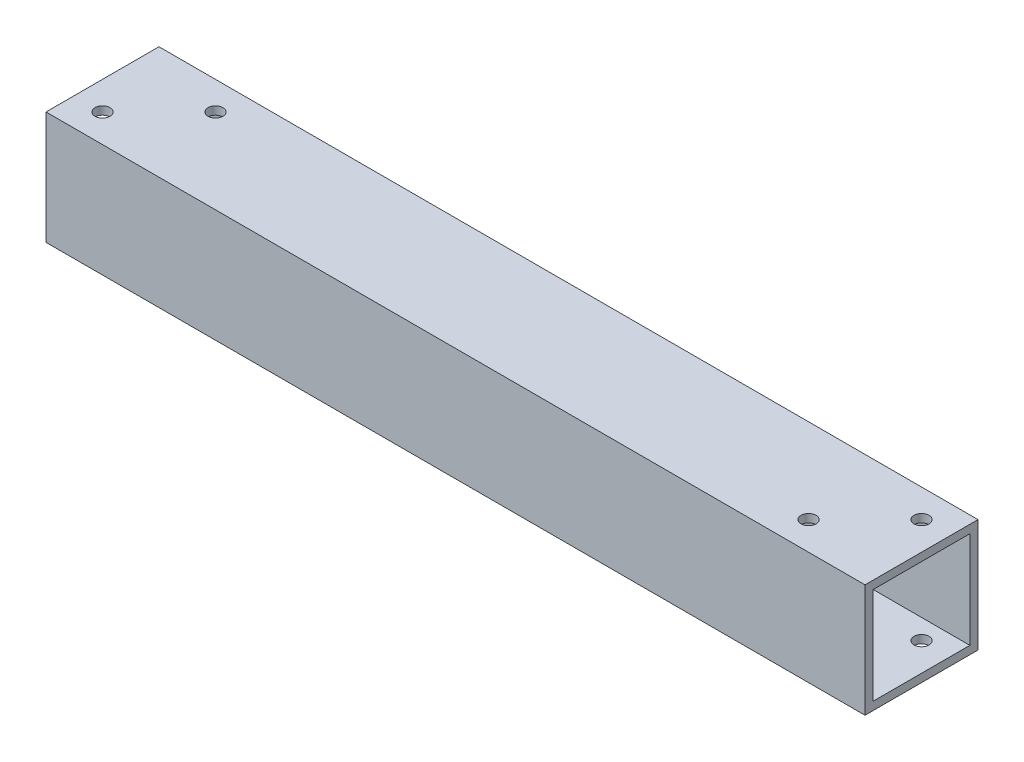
ISO-10303-21;
HEADER;
FILE_DESCRIPTION(('STEP AP214'),'2;1');
FILE_NAME('part.step','',(''),(''),'','','');
FILE_SCHEMA(('AUTOMOTIVE_DESIGN { 1 0 10303 214 1 1 1 1 }'));
ENDSEC;
DATA;
#1=APPLICATION_CONTEXT('core data for automotive mechanical design processes');
#2=APPLICATION_PROTOCOL_DEFINITION('international standard','automotive_design',2000,#1);
#3=PRODUCT_CONTEXT('',#1,'mechanical');
#4=PRODUCT('Part','Part','',(#3));
#5=PRODUCT_RELATED_PRODUCT_CATEGORY('part','',(#4));
#6=PRODUCT_DEFINITION_FORMATION('','',#4);
#7=PRODUCT_DEFINITION_CONTEXT('part definition',#1,'design');
#8=PRODUCT_DEFINITION('design','',#6,#7);
#9=PRODUCT_DEFINITION_SHAPE('','',#8);
#10=(LENGTH_UNIT() NAMED_UNIT(*) SI_UNIT(.MILLI.,.METRE.));
#11=(NAMED_UNIT(*) PLANE_ANGLE_UNIT() SI_UNIT($,.RADIAN.));
#12=(NAMED_UNIT(*) SI_UNIT($,.STERADIAN.) SOLID_ANGLE_UNIT());
#13=UNCERTAINTY_MEASURE_WITH_UNIT(LENGTH_MEASURE(1.E-05),#10,'distance_accuracy_value','');
#14=(GEOMETRIC_REPRESENTATION_CONTEXT(3) GLOBAL_UNCERTAINTY_ASSIGNED_CONTEXT((#13)) GLOBAL_UNIT_ASSIGNED_CONTEXT((#10,
#11,#12)) REPRESENTATION_CONTEXT('',''));
#15=CARTESIAN_POINT('',(0.,0.,0.));
#16=DIRECTION('',(0.,0.,1.));
#17=DIRECTION('',(1.,0.,0.));
#18=AXIS2_PLACEMENT_3D('',#15,#16,#17);
#19=CARTESIAN_POINT('',(368.3,50.8000000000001,0.));
#20=DIRECTION('',(-1.,0.,0.));
#21=DIRECTION('',(0.,0.,1.));
#22=AXIS2_PLACEMENT_3D('',#19,#20,#21);
#23=PLANE('',#22);
#24=DIRECTION('',(0.,-0.999999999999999,0.));
#25=VECTOR('',#24,1.);
#26=CARTESIAN_POINT('',(368.3,0.,0.));
#27=LINE('',#26,#25);
#28=CARTESIAN_POINT('',(368.3,50.8000000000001,0.));
#29=VERTEX_POINT('',#28);
#30=CARTESIAN_POINT('',(368.3,0.,0.));
#31=VERTEX_POINT('',#30);
#32=EDGE_CURVE('E135',#29,#31,#27,.T.);
#33=ORIENTED_EDGE('',*,*,#32,.T.);
#34=DIRECTION('',(0.,0.,-1.));
#35=VECTOR('',#34,1.);
#36=CARTESIAN_POINT('',(368.3,0.,0.));
#37=LINE('',#36,#35);
#38=CARTESIAN_POINT('',(368.3,0.,-50.7999999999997));
#39=VERTEX_POINT('',#38);
#40=EDGE_CURVE('E138',#31,#39,#37,.T.);
#41=ORIENTED_EDGE('',*,*,#40,.T.);
#42=DIRECTION('',(0.,0.999999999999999,0.));
#43=VECTOR('',#42,1.);
#44=CARTESIAN_POINT('',(368.3,0.,-50.7999999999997));
#45=LINE('',#44,#43);
#46=CARTESIAN_POINT('',(368.3,50.8000000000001,-50.7999999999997));
#47=VERTEX_POINT('',#46);
#48=EDGE_CURVE('E141',#39,#47,#45,.T.);
#49=ORIENTED_EDGE('',*,*,#48,.T.);
#50=DIRECTION('',(0.,0.,1.));
#51=VECTOR('',#50,1.);
#52=CARTESIAN_POINT('',(368.3,50.8000000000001,0.));
#53=LINE('',#52,#51);
#54=EDGE_CURVE('E143',#47,#29,#53,.T.);
#55=ORIENTED_EDGE('',*,*,#54,.T.);
#56=EDGE_LOOP('',(#33,#41,#49,#55));
#57=FACE_BOUND('',#56,.T.);
#58=DIRECTION('',(0.,-0.999999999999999,0.));
#59=VECTOR('',#58,1.);
#60=CARTESIAN_POINT('',(368.3,47.1423999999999,-3.65759999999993));
#61=LINE('',#60,#59);
#62=CARTESIAN_POINT('',(368.3,47.1423999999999,-3.65759999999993));
#63=VERTEX_POINT('',#62);
#64=CARTESIAN_POINT('',(368.3,3.65760000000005,-3.65759999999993));
#65=VERTEX_POINT('',#64);
#66=EDGE_CURVE('E97',#63,#65,#61,.T.);
#67=ORIENTED_EDGE('',*,*,#66,.F.);
#68=DIRECTION('',(0.,0.,1.));
#69=VECTOR('',#68,1.);
#70=CARTESIAN_POINT('',(368.3,47.1423999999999,-3.65759999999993));
#71=LINE('',#70,#69);
#72=CARTESIAN_POINT('',(368.3,47.1423999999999,-47.1423999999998));
#73=VERTEX_POINT('',#72);
#74=EDGE_CURVE('E119',#73,#63,#71,.T.);
#75=ORIENTED_EDGE('',*,*,#74,.F.);
#76=DIRECTION('',(0.,0.999999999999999,0.));
#77=VECTOR('',#76,1.);
#78=CARTESIAN_POINT('',(368.3,47.1423999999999,-47.1423999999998));
#79=LINE('',#78,#77);
#80=CARTESIAN_POINT('',(368.3,3.65760000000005,-47.1423999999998));
#81=VERTEX_POINT('',#80);
#82=EDGE_CURVE('E117',#81,#73,#79,.T.);
#83=ORIENTED_EDGE('',*,*,#82,.F.);
#84=DIRECTION('',(0.,0.,-1.));
#85=VECTOR('',#84,1.);
#86=CARTESIAN_POINT('',(368.3,3.65760000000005,-3.65759999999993));
#87=LINE('',#86,#85);
#88=EDGE_CURVE('E105',#65,#81,#87,.T.);
#89=ORIENTED_EDGE('',*,*,#88,.F.);
#90=EDGE_LOOP('',(#67,#75,#83,#89));
#91=FACE_BOUND('',#90,.T.);
#92=ADVANCED_FACE('F30',(#57,#91),#23,.F.);
#93=CARTESIAN_POINT('',(0.,50.7999999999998,0.));
#94=DIRECTION('',(-1.,0.,0.));
#95=DIRECTION('',(0.,0.,1.));
#96=AXIS2_PLACEMENT_3D('',#93,#94,#95);
#97=PLANE('',#96);
#98=DIRECTION('',(0.,-0.999999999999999,0.));
#99=VECTOR('',#98,1.);
#100=CARTESIAN_POINT('',(0.,0.,0.));
#101=LINE('',#100,#99);
#102=CARTESIAN_POINT('',(0.,50.7999999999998,0.));
#103=VERTEX_POINT('',#102);
#104=CARTESIAN_POINT('',(0.,0.,0.));
#105=VERTEX_POINT('',#104);
#106=EDGE_CURVE('E113',#103,#105,#101,.T.);
#107=ORIENTED_EDGE('',*,*,#106,.F.);
#108=DIRECTION('',(0.,0.,1.));
#109=VECTOR('',#108,1.);
#110=CARTESIAN_POINT('',(0.,50.7999999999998,0.));
#111=LINE('',#110,#109);
#112=CARTESIAN_POINT('',(0.,50.7999999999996,-50.8000000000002));
#113=VERTEX_POINT('',#112);
#114=EDGE_CURVE('E139',#113,#103,#111,.T.);
#115=ORIENTED_EDGE('',*,*,#114,.F.);
#116=DIRECTION('',(0.,0.999999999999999,0.));
#117=VECTOR('',#116,1.);
#118=CARTESIAN_POINT('',(0.,0.,-50.8000000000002));
#119=LINE('',#118,#117);
#120=CARTESIAN_POINT('',(0.,0.,-50.8000000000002));
#121=VERTEX_POINT('',#120);
#122=EDGE_CURVE('E150',#121,#113,#119,.T.);
#123=ORIENTED_EDGE('',*,*,#122,.F.);
#124=DIRECTION('',(0.,0.,-1.));
#125=VECTOR('',#124,1.);
#126=CARTESIAN_POINT('',(0.,0.,0.));
#127=LINE('',#126,#125);
#128=EDGE_CURVE('E148',#105,#121,#127,.T.);
#129=ORIENTED_EDGE('',*,*,#128,.F.);
#130=EDGE_LOOP('',(#107,#115,#123,#129));
#131=FACE_BOUND('',#130,.T.);
#132=DIRECTION('',(0.,0.,1.));
#133=VECTOR('',#132,1.);
#134=CARTESIAN_POINT('',(0.,47.1423999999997,-3.65759999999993));
#135=LINE('',#134,#133);
#136=CARTESIAN_POINT('',(0.,47.1423999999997,-47.1424000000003));
#137=VERTEX_POINT('',#136);
#138=CARTESIAN_POINT('',(0.,47.1423999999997,-3.65759999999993));
#139=VERTEX_POINT('',#138);
#140=EDGE_CURVE('E106',#137,#139,#135,.T.);
#141=ORIENTED_EDGE('',*,*,#140,.T.);
#142=DIRECTION('',(0.,-0.999999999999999,0.));
#143=VECTOR('',#142,1.);
#144=CARTESIAN_POINT('',(0.,47.1423999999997,-3.65759999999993));
#145=LINE('',#144,#143);
#146=CARTESIAN_POINT('',(0.,3.6575999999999,-3.65759999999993));
#147=VERTEX_POINT('',#146);
#148=EDGE_CURVE('E55',#139,#147,#145,.T.);
#149=ORIENTED_EDGE('',*,*,#148,.T.);
#150=DIRECTION('',(0.,0.,-1.));
#151=VECTOR('',#150,1.);
#152=CARTESIAN_POINT('',(0.,3.6575999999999,-3.65759999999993));
#153=LINE('',#152,#151);
#154=CARTESIAN_POINT('',(0.,3.6575999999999,-47.1424000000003));
#155=VERTEX_POINT('',#154);
#156=EDGE_CURVE('E112',#147,#155,#153,.T.);
#157=ORIENTED_EDGE('',*,*,#156,.T.);
#158=DIRECTION('',(0.,0.999999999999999,0.));
#159=VECTOR('',#158,1.);
#160=CARTESIAN_POINT('',(0.,47.1423999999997,-47.1424000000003));
#161=LINE('',#160,#159);
#162=EDGE_CURVE('E127',#155,#137,#161,.T.);
#163=ORIENTED_EDGE('',*,*,#162,.T.);
#164=EDGE_LOOP('',(#141,#149,#157,#163));
#165=FACE_BOUND('',#164,.T.);
#166=ADVANCED_FACE('F220',(#131,#165),#97,.T.);
#167=CARTESIAN_POINT('',(368.3,0.,0.));
#168=DIRECTION('',(0.,0.,-1.));
#169=DIRECTION('',(-1.,0.,0.));
#170=AXIS2_PLACEMENT_3D('',#167,#168,#169);
#171=PLANE('',#170);
#172=ORIENTED_EDGE('',*,*,#106,.T.);
#173=DIRECTION('',(-1.,0.,0.));
#174=VECTOR('',#173,1.);
#175=CARTESIAN_POINT('',(368.3,0.,0.));
#176=LINE('',#175,#174);
#177=EDGE_CURVE('E11',#31,#105,#176,.T.);
#178=ORIENTED_EDGE('',*,*,#177,.F.);
#179=ORIENTED_EDGE('',*,*,#32,.F.);
#180=DIRECTION('',(-1.,0.,0.));
#181=VECTOR('',#180,1.);
#182=CARTESIAN_POINT('',(368.3,50.8000000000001,0.));
#183=LINE('',#182,#181);
#184=EDGE_CURVE('E145',#29,#103,#183,.T.);
#185=ORIENTED_EDGE('',*,*,#184,.T.);
#186=EDGE_LOOP('',(#172,#178,#179,#185));
#187=FACE_BOUND('',#186,.T.);
#188=ADVANCED_FACE('F32',(#187),#171,.F.);
#189=CARTESIAN_POINT('',(368.3,0.,0.));
#190=DIRECTION('',(0.,0.999999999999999,0.));
#191=DIRECTION('',(0.,0.,1.));
#192=AXIS2_PLACEMENT_3D('',#189,#190,#191);
#193=PLANE('',#192);
#194=CARTESIAN_POINT('',(330.2,0.,-12.6999999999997));
#195=DIRECTION('',(0.,0.999999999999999,0.));
#196=DIRECTION('',(0.,0.,1.));
#197=AXIS2_PLACEMENT_3D('',#194,#195,#196);
#198=CIRCLE('',#197,3.37311999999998);
#199=CARTESIAN_POINT('',(330.2,0.,-9.32687999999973));
#200=VERTEX_POINT('',#199);
#201=EDGE_CURVE('E244',#200,#200,#198,.T.);
#202=ORIENTED_EDGE('',*,*,#201,.T.);
#203=EDGE_LOOP('',(#202));
#204=FACE_BOUND('',#203,.T.);
#205=CARTESIAN_POINT('',(355.6,0.,-38.1));
#206=DIRECTION('',(0.,0.999999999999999,0.));
#207=DIRECTION('',(0.,0.,1.));
#208=AXIS2_PLACEMENT_3D('',#205,#206,#207);
#209=CIRCLE('',#208,3.37312000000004);
#210=CARTESIAN_POINT('',(355.6,0.,-34.72688));
#211=VERTEX_POINT('',#210);
#212=EDGE_CURVE('E171',#211,#211,#209,.T.);
#213=ORIENTED_EDGE('',*,*,#212,.T.);
#214=EDGE_LOOP('',(#213));
#215=FACE_BOUND('',#214,.T.);
#216=CARTESIAN_POINT('',(38.1,0.,-38.1));
#217=DIRECTION('',(0.,0.999999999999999,0.));
#218=DIRECTION('',(0.,0.,1.));
#219=AXIS2_PLACEMENT_3D('',#216,#217,#218);
#220=CIRCLE('',#219,3.37312);
#221=CARTESIAN_POINT('',(38.1,0.,-34.72688));
#222=VERTEX_POINT('',#221);
#223=EDGE_CURVE('E167',#222,#222,#220,.T.);
#224=ORIENTED_EDGE('',*,*,#223,.T.);
#225=EDGE_LOOP('',(#224));
#226=FACE_BOUND('',#225,.T.);
#227=CARTESIAN_POINT('',(12.7,0.,-12.7000000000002));
#228=DIRECTION('',(0.,0.999999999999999,0.));
#229=DIRECTION('',(0.,0.,1.));
#230=AXIS2_PLACEMENT_3D('',#227,#228,#229);
#231=CIRCLE('',#230,3.37312);
#232=CARTESIAN_POINT('',(12.7,0.,-9.32688000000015));
#233=VERTEX_POINT('',#232);
#234=EDGE_CURVE('E163',#233,#233,#231,.T.);
#235=ORIENTED_EDGE('',*,*,#234,.T.);
#236=EDGE_LOOP('',(#235));
#237=FACE_BOUND('',#236,.T.);
#238=ORIENTED_EDGE('',*,*,#128,.T.);
#239=DIRECTION('',(-1.,0.,0.));
#240=VECTOR('',#239,1.);
#241=CARTESIAN_POINT('',(368.3,0.,-50.7999999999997));
#242=LINE('',#241,#240);
#243=EDGE_CURVE('E39',#39,#121,#242,.T.);
#244=ORIENTED_EDGE('',*,*,#243,.F.);
#245=ORIENTED_EDGE('',*,*,#40,.F.);
#246=ORIENTED_EDGE('',*,*,#177,.T.);
#247=EDGE_LOOP('',(#238,#244,#245,#246));
#248=FACE_BOUND('',#247,.T.);
#249=ADVANCED_FACE('F234',(#204,#215,#226,#237,#248),#193,.F.);
#250=CARTESIAN_POINT('',(368.3,0.,-50.7999999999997));
#251=DIRECTION('',(0.,0.,1.));
#252=DIRECTION('',(1.,0.,0.));
#253=AXIS2_PLACEMENT_3D('',#250,#251,#252);
#254=PLANE('',#253);
#255=ORIENTED_EDGE('',*,*,#122,.T.);
#256=DIRECTION('',(-1.,0.,0.));
#257=VECTOR('',#256,1.);
#258=CARTESIAN_POINT('',(368.3,50.8000000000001,-50.7999999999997));
#259=LINE('',#258,#257);
#260=EDGE_CURVE('E155',#47,#113,#259,.T.);
#261=ORIENTED_EDGE('',*,*,#260,.F.);
#262=ORIENTED_EDGE('',*,*,#48,.F.);
#263=ORIENTED_EDGE('',*,*,#243,.T.);
#264=EDGE_LOOP('',(#255,#261,#262,#263));
#265=FACE_BOUND('',#264,.T.);
#266=ADVANCED_FACE('F231',(#265),#254,.F.);
#267=CARTESIAN_POINT('',(368.3,50.8000000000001,0.));
#268=DIRECTION('',(0.,-0.999999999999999,0.));
#269=DIRECTION('',(0.,0.,-1.));
#270=AXIS2_PLACEMENT_3D('',#267,#268,#269);
#271=PLANE('',#270);
#272=CARTESIAN_POINT('',(330.2,50.8000000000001,-12.6999999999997));
#273=DIRECTION('',(0.,0.999999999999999,0.));
#274=DIRECTION('',(0.,0.,1.));
#275=AXIS2_PLACEMENT_3D('',#272,#273,#274);
#276=CIRCLE('',#275,3.37311999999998);
#277=CARTESIAN_POINT('',(330.2,50.8,-9.32687999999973));
#278=VERTEX_POINT('',#277);
#279=EDGE_CURVE('E298',#278,#278,#276,.T.);
#280=ORIENTED_EDGE('',*,*,#279,.F.);
#281=EDGE_LOOP('',(#280));
#282=FACE_BOUND('',#281,.T.);
#283=CARTESIAN_POINT('',(355.6,50.8000000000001,-38.1));
#284=DIRECTION('',(0.,0.999999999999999,0.));
#285=DIRECTION('',(0.,0.,1.));
#286=AXIS2_PLACEMENT_3D('',#283,#284,#285);
#287=CIRCLE('',#286,3.37312000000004);
#288=CARTESIAN_POINT('',(355.6,50.8000000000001,-34.72688));
#289=VERTEX_POINT('',#288);
#290=EDGE_CURVE('E178',#289,#289,#287,.T.);
#291=ORIENTED_EDGE('',*,*,#290,.F.);
#292=EDGE_LOOP('',(#291));
#293=FACE_BOUND('',#292,.T.);
#294=CARTESIAN_POINT('',(38.1,50.7999999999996,-38.1));
#295=DIRECTION('',(0.,0.999999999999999,0.));
#296=DIRECTION('',(0.,0.,1.));
#297=AXIS2_PLACEMENT_3D('',#294,#295,#296);
#298=CIRCLE('',#297,3.37312);
#299=CARTESIAN_POINT('',(38.1,50.7999999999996,-34.72688));
#300=VERTEX_POINT('',#299);
#301=EDGE_CURVE('E175',#300,#300,#298,.T.);
#302=ORIENTED_EDGE('',*,*,#301,.F.);
#303=EDGE_LOOP('',(#302));
#304=FACE_BOUND('',#303,.T.);
#305=CARTESIAN_POINT('',(12.7,50.7999999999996,-12.7000000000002));
#306=DIRECTION('',(0.,0.999999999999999,0.));
#307=DIRECTION('',(0.,0.,1.));
#308=AXIS2_PLACEMENT_3D('',#305,#306,#307);
#309=CIRCLE('',#308,3.37312);
#310=CARTESIAN_POINT('',(12.7000000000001,50.7999999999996,-9.32688000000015));
#311=VERTEX_POINT('',#310);
#312=EDGE_CURVE('E194',#311,#311,#309,.T.);
#313=ORIENTED_EDGE('',*,*,#312,.F.);
#314=EDGE_LOOP('',(#313));
#315=FACE_BOUND('',#314,.T.);
#316=ORIENTED_EDGE('',*,*,#114,.T.);
#317=ORIENTED_EDGE('',*,*,#184,.F.);
#318=ORIENTED_EDGE('',*,*,#54,.F.);
#319=ORIENTED_EDGE('',*,*,#260,.T.);
#320=EDGE_LOOP('',(#316,#317,#318,#319));
#321=FACE_BOUND('',#320,.T.);
#322=ADVANCED_FACE('F215',(#282,#293,#304,#315,#321),#271,.F.);
#323=CARTESIAN_POINT('',(368.3,47.1423999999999,-3.65759999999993));
#324=DIRECTION('',(0.,0.,-1.));
#325=DIRECTION('',(0.,0.999999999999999,0.));
#326=AXIS2_PLACEMENT_3D('',#323,#324,#325);
#327=PLANE('',#326);
#328=ORIENTED_EDGE('',*,*,#148,.F.);
#329=DIRECTION('',(-1.,0.,0.));
#330=VECTOR('',#329,1.);
#331=CARTESIAN_POINT('',(368.3,47.1423999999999,-3.65759999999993));
#332=LINE('',#331,#330);
#333=EDGE_CURVE('E101',#63,#139,#332,.T.);
#334=ORIENTED_EDGE('',*,*,#333,.F.);
#335=ORIENTED_EDGE('',*,*,#66,.T.);
#336=DIRECTION('',(-1.,0.,0.));
#337=VECTOR('',#336,1.);
#338=CARTESIAN_POINT('',(368.3,3.65760000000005,-3.65759999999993));
#339=LINE('',#338,#337);
#340=EDGE_CURVE('E100',#65,#147,#339,.T.);
#341=ORIENTED_EDGE('',*,*,#340,.T.);
#342=EDGE_LOOP('',(#328,#334,#335,#341));
#343=FACE_BOUND('',#342,.T.);
#344=ADVANCED_FACE('F99',(#343),#327,.T.);
#345=CARTESIAN_POINT('',(368.3,3.65760000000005,-3.65759999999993));
#346=DIRECTION('',(0.,0.999999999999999,0.));
#347=DIRECTION('',(0.,0.,1.));
#348=AXIS2_PLACEMENT_3D('',#345,#346,#347);
#349=PLANE('',#348);
#350=CARTESIAN_POINT('',(330.2,3.65760000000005,-12.6999999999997));
#351=DIRECTION('',(0.,0.999999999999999,0.));
#352=DIRECTION('',(0.,0.,1.));
#353=AXIS2_PLACEMENT_3D('',#350,#351,#352);
#354=CIRCLE('',#353,3.37311999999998);
#355=CARTESIAN_POINT('',(330.2,3.65760000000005,-9.32687999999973));
#356=VERTEX_POINT('',#355);
#357=EDGE_CURVE('E183',#356,#356,#354,.T.);
#358=ORIENTED_EDGE('',*,*,#357,.F.);
#359=EDGE_LOOP('',(#358));
#360=FACE_BOUND('',#359,.T.);
#361=CARTESIAN_POINT('',(355.6,3.65760000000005,-38.1));
#362=DIRECTION('',(0.,0.999999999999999,0.));
#363=DIRECTION('',(0.,0.,1.));
#364=AXIS2_PLACEMENT_3D('',#361,#362,#363);
#365=CIRCLE('',#364,3.37312000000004);
#366=CARTESIAN_POINT('',(355.6,3.65760000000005,-34.72688));
#367=VERTEX_POINT('',#366);
#368=EDGE_CURVE('E170',#367,#367,#365,.T.);
#369=ORIENTED_EDGE('',*,*,#368,.F.);
#370=EDGE_LOOP('',(#369));
#371=FACE_BOUND('',#370,.T.);
#372=CARTESIAN_POINT('',(38.1,3.6575999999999,-38.1));
#373=DIRECTION('',(0.,0.999999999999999,0.));
#374=DIRECTION('',(0.,0.,1.));
#375=AXIS2_PLACEMENT_3D('',#372,#373,#374);
#376=CIRCLE('',#375,3.37312);
#377=CARTESIAN_POINT('',(38.1,3.6575999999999,-34.72688));
#378=VERTEX_POINT('',#377);
#379=EDGE_CURVE('E166',#378,#378,#376,.T.);
#380=ORIENTED_EDGE('',*,*,#379,.F.);
#381=EDGE_LOOP('',(#380));
#382=FACE_BOUND('',#381,.T.);
#383=CARTESIAN_POINT('',(12.7,3.6575999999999,-12.7000000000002));
#384=DIRECTION('',(0.,0.999999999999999,0.));
#385=DIRECTION('',(0.,0.,1.));
#386=AXIS2_PLACEMENT_3D('',#383,#384,#385);
#387=CIRCLE('',#386,3.37312);
#388=CARTESIAN_POINT('',(12.7,3.6575999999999,-9.32688000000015));
#389=VERTEX_POINT('',#388);
#390=EDGE_CURVE('E125',#389,#389,#387,.T.);
#391=ORIENTED_EDGE('',*,*,#390,.F.);
#392=EDGE_LOOP('',(#391));
#393=FACE_BOUND('',#392,.T.);
#394=ORIENTED_EDGE('',*,*,#156,.F.);
#395=ORIENTED_EDGE('',*,*,#340,.F.);
#396=ORIENTED_EDGE('',*,*,#88,.T.);
#397=DIRECTION('',(-1.,0.,0.));
#398=VECTOR('',#397,1.);
#399=CARTESIAN_POINT('',(368.3,3.65760000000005,-47.1423999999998));
#400=LINE('',#399,#398);
#401=EDGE_CURVE('E114',#81,#155,#400,.T.);
#402=ORIENTED_EDGE('',*,*,#401,.T.);
#403=EDGE_LOOP('',(#394,#395,#396,#402));
#404=FACE_BOUND('',#403,.T.);
#405=ADVANCED_FACE('F109',(#360,#371,#382,#393,#404),#349,.T.);
#406=CARTESIAN_POINT('',(368.3,47.1423999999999,-47.1423999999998));
#407=DIRECTION('',(0.,0.,1.));
#408=DIRECTION('',(0.,-0.999999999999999,0.));
#409=AXIS2_PLACEMENT_3D('',#406,#407,#408);
#410=PLANE('',#409);
#411=ORIENTED_EDGE('',*,*,#162,.F.);
#412=ORIENTED_EDGE('',*,*,#401,.F.);
#413=ORIENTED_EDGE('',*,*,#82,.T.);
#414=DIRECTION('',(-1.,0.,0.));
#415=VECTOR('',#414,1.);
#416=CARTESIAN_POINT('',(368.3,47.1423999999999,-47.1423999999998));
#417=LINE('',#416,#415);
#418=EDGE_CURVE('E47',#73,#137,#417,.T.);
#419=ORIENTED_EDGE('',*,*,#418,.T.);
#420=EDGE_LOOP('',(#411,#412,#413,#419));
#421=FACE_BOUND('',#420,.T.);
#422=ADVANCED_FACE('F205',(#421),#410,.T.);
#423=CARTESIAN_POINT('',(368.3,47.1423999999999,-3.65759999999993));
#424=DIRECTION('',(0.,-0.999999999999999,0.));
#425=DIRECTION('',(0.,0.,-1.));
#426=AXIS2_PLACEMENT_3D('',#423,#424,#425);
#427=PLANE('',#426);
#428=CARTESIAN_POINT('',(330.2,47.1423999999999,-12.6999999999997));
#429=DIRECTION('',(0.,-0.999999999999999,0.));
#430=DIRECTION('',(0.,0.,-1.));
#431=AXIS2_PLACEMENT_3D('',#428,#429,#430);
#432=CIRCLE('',#431,3.37311999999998);
#433=CARTESIAN_POINT('',(330.2,47.1423999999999,-9.32687999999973));
#434=VERTEX_POINT('',#433);
#435=EDGE_CURVE('E34',#434,#434,#432,.T.);
#436=ORIENTED_EDGE('',*,*,#435,.F.);
#437=EDGE_LOOP('',(#436));
#438=FACE_BOUND('',#437,.T.);
#439=CARTESIAN_POINT('',(355.6,47.1423999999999,-38.1));
#440=DIRECTION('',(0.,-0.999999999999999,0.));
#441=DIRECTION('',(0.,0.,-1.));
#442=AXIS2_PLACEMENT_3D('',#439,#440,#441);
#443=CIRCLE('',#442,3.37312000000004);
#444=CARTESIAN_POINT('',(355.6,47.1423999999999,-34.72688));
#445=VERTEX_POINT('',#444);
#446=EDGE_CURVE('E168',#445,#445,#443,.T.);
#447=ORIENTED_EDGE('',*,*,#446,.F.);
#448=EDGE_LOOP('',(#447));
#449=FACE_BOUND('',#448,.T.);
#450=CARTESIAN_POINT('',(38.1,47.1423999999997,-38.1));
#451=DIRECTION('',(0.,-0.999999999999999,0.));
#452=DIRECTION('',(0.,0.,-1.));
#453=AXIS2_PLACEMENT_3D('',#450,#451,#452);
#454=CIRCLE('',#453,3.37312);
#455=CARTESIAN_POINT('',(38.1,47.1423999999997,-34.72688));
#456=VERTEX_POINT('',#455);
#457=EDGE_CURVE('E164',#456,#456,#454,.T.);
#458=ORIENTED_EDGE('',*,*,#457,.F.);
#459=EDGE_LOOP('',(#458));
#460=FACE_BOUND('',#459,.T.);
#461=CARTESIAN_POINT('',(12.7,47.1423999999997,-12.7000000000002));
#462=DIRECTION('',(0.,-0.999999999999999,0.));
#463=DIRECTION('',(0.,0.,-1.));
#464=AXIS2_PLACEMENT_3D('',#461,#462,#463);
#465=CIRCLE('',#464,3.37312);
#466=CARTESIAN_POINT('',(12.7000000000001,47.1423999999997,-9.32688000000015));
#467=VERTEX_POINT('',#466);
#468=EDGE_CURVE('E160',#467,#467,#465,.T.);
#469=ORIENTED_EDGE('',*,*,#468,.F.);
#470=EDGE_LOOP('',(#469));
#471=FACE_BOUND('',#470,.T.);
#472=ORIENTED_EDGE('',*,*,#140,.F.);
#473=ORIENTED_EDGE('',*,*,#418,.F.);
#474=ORIENTED_EDGE('',*,*,#74,.T.);
#475=ORIENTED_EDGE('',*,*,#333,.T.);
#476=EDGE_LOOP('',(#472,#473,#474,#475));
#477=FACE_BOUND('',#476,.T.);
#478=ADVANCED_FACE('F212',(#438,#449,#460,#471,#477),#427,.T.);
#479=CARTESIAN_POINT('',(12.7,0.,-12.7000000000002));
#480=DIRECTION('',(0.,0.999999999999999,0.));
#481=DIRECTION('',(0.,0.,1.));
#482=AXIS2_PLACEMENT_3D('',#479,#480,#481);
#483=CYLINDRICAL_SURFACE('',#482,3.37312);
#484=CARTESIAN_POINT('',(12.7000000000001,47.1423999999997,-9.32688000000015));
#485=CARTESIAN_POINT('',(12.7000000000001,47.1804999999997,-9.32688000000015));
#486=CARTESIAN_POINT('',(12.7000000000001,47.2185999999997,-9.32688000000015));
#487=CARTESIAN_POINT('',(12.7000000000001,47.2947999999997,-9.32688000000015));
#488=CARTESIAN_POINT('',(12.7000000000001,47.3328999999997,-9.32688000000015));
#489=CARTESIAN_POINT('',(12.7000000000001,47.4090999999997,-9.32688000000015));
#490=CARTESIAN_POINT('',(12.7000000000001,47.4471999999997,-9.32688000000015));
#491=CARTESIAN_POINT('',(12.7000000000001,47.5233999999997,-9.32688000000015));
#492=CARTESIAN_POINT('',(12.7000000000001,47.5614999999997,-9.32688000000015));
#493=CARTESIAN_POINT('',(12.7000000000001,47.6376999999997,-9.32688000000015));
#494=CARTESIAN_POINT('',(12.7000000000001,47.6757999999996,-9.32688000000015));
#495=CARTESIAN_POINT('',(12.7000000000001,47.7519999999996,-9.32688000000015));
#496=CARTESIAN_POINT('',(12.7000000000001,47.7900999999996,-9.32688000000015));
#497=CARTESIAN_POINT('',(12.7000000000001,47.8662999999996,-9.32688000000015));
#498=CARTESIAN_POINT('',(12.7000000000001,47.9043999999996,-9.32688000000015));
#499=CARTESIAN_POINT('',(12.7000000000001,47.9805999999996,-9.32688000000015));
#500=CARTESIAN_POINT('',(12.7000000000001,48.0186999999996,-9.32688000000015));
#501=CARTESIAN_POINT('',(12.7000000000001,48.0948999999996,-9.32688000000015));
#502=CARTESIAN_POINT('',(12.7000000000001,48.1329999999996,-9.32688000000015));
#503=CARTESIAN_POINT('',(12.7000000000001,48.2091999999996,-9.32688000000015));
#504=CARTESIAN_POINT('',(12.7000000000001,48.2472999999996,-9.32688000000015));
#505=CARTESIAN_POINT('',(12.7000000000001,48.3234999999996,-9.32688000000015));
#506=CARTESIAN_POINT('',(12.7000000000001,48.3615999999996,-9.32688000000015));
#507=CARTESIAN_POINT('',(12.7000000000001,48.4377999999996,-9.32688000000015));
#508=CARTESIAN_POINT('',(12.7000000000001,48.4758999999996,-9.32688000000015));
#509=CARTESIAN_POINT('',(12.7000000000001,48.5520999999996,-9.32688000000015));
#510=CARTESIAN_POINT('',(12.7000000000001,48.5901999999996,-9.32688000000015));
#511=CARTESIAN_POINT('',(12.7000000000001,48.6663999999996,-9.32688000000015));
#512=CARTESIAN_POINT('',(12.7000000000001,48.7044999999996,-9.32688000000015));
#513=CARTESIAN_POINT('',(12.7000000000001,48.7806999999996,-9.32688000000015));
#514=CARTESIAN_POINT('',(12.7000000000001,48.8187999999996,-9.32688000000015));
#515=CARTESIAN_POINT('',(12.7000000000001,48.8949999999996,-9.32688000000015));
#516=CARTESIAN_POINT('',(12.7000000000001,48.9330999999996,-9.32688000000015));
#517=CARTESIAN_POINT('',(12.7000000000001,49.0092999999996,-9.32688000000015));
#518=CARTESIAN_POINT('',(12.7000000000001,49.0473999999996,-9.32688000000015));
#519=CARTESIAN_POINT('',(12.7000000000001,49.1235999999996,-9.32688000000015));
#520=CARTESIAN_POINT('',(12.7000000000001,49.1616999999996,-9.32688000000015));
#521=CARTESIAN_POINT('',(12.7000000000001,49.2378999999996,-9.32688000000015));
#522=CARTESIAN_POINT('',(12.7000000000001,49.2759999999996,-9.32688000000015));
#523=CARTESIAN_POINT('',(12.7000000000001,49.3521999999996,-9.32688000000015));
#524=CARTESIAN_POINT('',(12.7000000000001,49.3902999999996,-9.32688000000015));
#525=CARTESIAN_POINT('',(12.7000000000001,49.4664999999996,-9.32688000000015));
#526=CARTESIAN_POINT('',(12.7000000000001,49.5045999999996,-9.32688000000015));
#527=CARTESIAN_POINT('',(12.7000000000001,49.5807999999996,-9.32688000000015));
#528=CARTESIAN_POINT('',(12.7000000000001,49.6188999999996,-9.32688000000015));
#529=CARTESIAN_POINT('',(12.7000000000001,49.6950999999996,-9.32688000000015));
#530=CARTESIAN_POINT('',(12.7000000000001,49.7331999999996,-9.32688000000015));
#531=CARTESIAN_POINT('',(12.7000000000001,49.8093999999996,-9.32688000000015));
#532=CARTESIAN_POINT('',(12.7000000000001,49.8474999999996,-9.32688000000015));
#533=CARTESIAN_POINT('',(12.7000000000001,49.9236999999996,-9.32688000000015));
#534=CARTESIAN_POINT('',(12.7000000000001,49.9617999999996,-9.32688000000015));
#535=CARTESIAN_POINT('',(12.7000000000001,50.0379999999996,-9.32688000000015));
#536=CARTESIAN_POINT('',(12.7000000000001,50.0760999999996,-9.32688000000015));
#537=CARTESIAN_POINT('',(12.7000000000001,50.1522999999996,-9.32688000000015));
#538=CARTESIAN_POINT('',(12.7000000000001,50.1903999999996,-9.32688000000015));
#539=CARTESIAN_POINT('',(12.7000000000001,50.2665999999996,-9.32688000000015));
#540=CARTESIAN_POINT('',(12.7000000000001,50.3046999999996,-9.32688000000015));
#541=CARTESIAN_POINT('',(12.7000000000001,50.3808999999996,-9.32688000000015));
#542=CARTESIAN_POINT('',(12.7000000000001,50.4189999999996,-9.32688000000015));
#543=CARTESIAN_POINT('',(12.7000000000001,50.4951999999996,-9.32688000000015));
#544=CARTESIAN_POINT('',(12.7000000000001,50.5332999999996,-9.32688000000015));
#545=CARTESIAN_POINT('',(12.7000000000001,50.6094999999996,-9.32688000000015));
#546=CARTESIAN_POINT('',(12.7000000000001,50.6475999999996,-9.32688000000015));
#547=CARTESIAN_POINT('',(12.7000000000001,50.7237999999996,-9.32688000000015));
#548=CARTESIAN_POINT('',(12.7000000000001,50.7618999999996,-9.32688000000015));
#549=CARTESIAN_POINT('',(12.7000000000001,50.7999999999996,-9.32688000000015));
#550=B_SPLINE_CURVE_WITH_KNOTS('',3,(#484,#485,#486,#487,#488,#489,#490,#491,#492,#493,#494,
#495,#496,#497,#498,#499,#500,#501,#502,#503,#504,#505,#506,#507,#508,#509,#510,#511,#512,#513,
#514,#515,#516,#517,#518,#519,#520,#521,#522,#523,#524,#525,#526,#527,#528,#529,#530,#531,#532,
#533,#534,#535,#536,#537,#538,#539,#540,#541,#542,#543,#544,#545,#546,#547,#548,#549),
.UNSPECIFIED.,.F.,.F.,(4,2,2,2,2,2,2,2,2,2,2,2,2,2,2,2,2,2,2,2,2,2,2,2,2,2,2,2,2,2,2,2,4),(0.,
0.114299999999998,0.228599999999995,0.342899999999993,0.457199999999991,0.571499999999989,
0.685799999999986,0.800099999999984,0.914399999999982,1.02869999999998,1.14299999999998,
1.25729999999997,1.37159999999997,1.48589999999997,1.60019999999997,1.71449999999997,
1.82879999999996,1.94309999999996,2.05739999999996,2.17169999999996,2.28599999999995,
2.40029999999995,2.51459999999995,2.62889999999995,2.74319999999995,2.85749999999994,
2.97179999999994,3.08609999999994,3.20039999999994,3.31469999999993,3.42899999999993,
3.54329999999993,3.65759999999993),.UNSPECIFIED.);
#551=EDGE_CURVE('BSEAM264',#467,#311,#550,.T.);
#552=ORIENTED_EDGE('',*,*,#468,.T.);
#553=ORIENTED_EDGE('',*,*,#312,.T.);
#554=ORIENTED_EDGE('',*,*,#551,.T.);
#555=ORIENTED_EDGE('',*,*,#551,.F.);
#556=EDGE_LOOP('',(#552,#554,#553,#555));
#557=FACE_BOUND('',#556,.T.);
#558=ADVANCED_FACE('F264',(#557),#483,.F.);
#559=CARTESIAN_POINT('',(12.7,3.6575999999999,-9.32688000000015));
#560=CARTESIAN_POINT('',(12.7,3.6194999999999,-9.32688000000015));
#561=CARTESIAN_POINT('',(12.7,3.5813999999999,-9.32688000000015));
#562=CARTESIAN_POINT('',(12.7,3.50519999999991,-9.32688000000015));
#563=CARTESIAN_POINT('',(12.7,3.46709999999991,-9.32688000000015));
#564=CARTESIAN_POINT('',(12.7,3.39089999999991,-9.32688000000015));
#565=CARTESIAN_POINT('',(12.7,3.35279999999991,-9.32688000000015));
#566=CARTESIAN_POINT('',(12.7,3.27659999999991,-9.32688000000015));
#567=CARTESIAN_POINT('',(12.7,3.23849999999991,-9.32688000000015));
#568=CARTESIAN_POINT('',(12.7,3.16229999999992,-9.32688000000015));
#569=CARTESIAN_POINT('',(12.7,3.12419999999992,-9.32688000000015));
#570=CARTESIAN_POINT('',(12.7,3.04799999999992,-9.32688000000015));
#571=CARTESIAN_POINT('',(12.7,3.00989999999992,-9.32688000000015));
#572=CARTESIAN_POINT('',(12.7,2.93369999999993,-9.32688000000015));
#573=CARTESIAN_POINT('',(12.7,2.89559999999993,-9.32688000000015));
#574=CARTESIAN_POINT('',(12.7,2.81939999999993,-9.32688000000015));
#575=CARTESIAN_POINT('',(12.7,2.78129999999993,-9.32688000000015));
#576=CARTESIAN_POINT('',(12.7,2.70509999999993,-9.32688000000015));
#577=CARTESIAN_POINT('',(12.7,2.66699999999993,-9.32688000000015));
#578=CARTESIAN_POINT('',(12.7,2.59079999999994,-9.32688000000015));
#579=CARTESIAN_POINT('',(12.7,2.55269999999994,-9.32688000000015));
#580=CARTESIAN_POINT('',(12.7,2.47649999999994,-9.32688000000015));
#581=CARTESIAN_POINT('',(12.7,2.43839999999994,-9.32688000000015));
#582=CARTESIAN_POINT('',(12.7,2.36219999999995,-9.32688000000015));
#583=CARTESIAN_POINT('',(12.7,2.32409999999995,-9.32688000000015));
#584=CARTESIAN_POINT('',(12.7,2.24789999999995,-9.32688000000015));
#585=CARTESIAN_POINT('',(12.7,2.20979999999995,-9.32688000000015));
#586=CARTESIAN_POINT('',(12.7,2.13359999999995,-9.32688000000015));
#587=CARTESIAN_POINT('',(12.7,2.09549999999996,-9.32688000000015));
#588=CARTESIAN_POINT('',(12.7,2.01929999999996,-9.32688000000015));
#589=CARTESIAN_POINT('',(12.7,1.98119999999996,-9.32688000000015));
#590=CARTESIAN_POINT('',(12.7,1.90499999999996,-9.32688000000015));
#591=CARTESIAN_POINT('',(12.7,1.86689999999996,-9.32688000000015));
#592=CARTESIAN_POINT('',(12.7,1.79069999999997,-9.32688000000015));
#593=CARTESIAN_POINT('',(12.7,1.75259999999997,-9.32688000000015));
#594=CARTESIAN_POINT('',(12.7,1.67639999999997,-9.32688000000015));
#595=CARTESIAN_POINT('',(12.7,1.63829999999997,-9.32688000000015));
#596=CARTESIAN_POINT('',(12.7,1.56209999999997,-9.32688000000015));
#597=CARTESIAN_POINT('',(12.7,1.52399999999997,-9.32688000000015));
#598=CARTESIAN_POINT('',(12.7,1.44779999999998,-9.32688000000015));
#599=CARTESIAN_POINT('',(12.7,1.40969999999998,-9.32688000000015));
#600=CARTESIAN_POINT('',(12.7,1.33349999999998,-9.32688000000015));
#601=CARTESIAN_POINT('',(12.7,1.29539999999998,-9.32688000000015));
#602=CARTESIAN_POINT('',(12.7,1.21919999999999,-9.32688000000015));
#603=CARTESIAN_POINT('',(12.7,1.18109999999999,-9.32688000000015));
#604=CARTESIAN_POINT('',(12.7,1.10489999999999,-9.32688000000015));
#605=CARTESIAN_POINT('',(12.7,1.06679999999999,-9.32688000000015));
#606=CARTESIAN_POINT('',(12.7,0.990599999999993,-9.32688000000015));
#607=CARTESIAN_POINT('',(12.7,0.952499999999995,-9.32688000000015));
#608=CARTESIAN_POINT('',(12.7,0.876299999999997,-9.32688000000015));
#609=CARTESIAN_POINT('',(12.7,0.838199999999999,-9.32688000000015));
#610=CARTESIAN_POINT('',(12.7,0.762000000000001,-9.32688000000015));
#611=CARTESIAN_POINT('',(12.7,0.723900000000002,-9.32688000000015));
#612=CARTESIAN_POINT('',(12.7,0.647700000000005,-9.32688000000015));
#613=CARTESIAN_POINT('',(12.7,0.609600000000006,-9.32688000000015));
#614=CARTESIAN_POINT('',(12.7,0.533400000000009,-9.32688000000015));
#615=CARTESIAN_POINT('',(12.7,0.495300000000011,-9.32688000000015));
#616=CARTESIAN_POINT('',(12.7,0.419100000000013,-9.32688000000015));
#617=CARTESIAN_POINT('',(12.7,0.381000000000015,-9.32688000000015));
#618=CARTESIAN_POINT('',(12.7,0.304800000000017,-9.32688000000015));
#619=CARTESIAN_POINT('',(12.7,0.266700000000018,-9.32688000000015));
#620=CARTESIAN_POINT('',(12.7,0.190500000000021,-9.32688000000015));
#621=CARTESIAN_POINT('',(12.7,0.152400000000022,-9.32688000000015));
#622=CARTESIAN_POINT('',(12.7,0.0762000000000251,-9.32688000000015));
#623=CARTESIAN_POINT('',(12.7,0.0381000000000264,-9.32688000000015));
#624=CARTESIAN_POINT('',(12.7,0.,-9.32688000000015));
#625=B_SPLINE_CURVE_WITH_KNOTS('',3,(#559,#560,#561,#562,#563,#564,#565,#566,#567,#568,#569,
#570,#571,#572,#573,#574,#575,#576,#577,#578,#579,#580,#581,#582,#583,#584,#585,#586,#587,#588,
#589,#590,#591,#592,#593,#594,#595,#596,#597,#598,#599,#600,#601,#602,#603,#604,#605,#606,#607,
#608,#609,#610,#611,#612,#613,#614,#615,#616,#617,#618,#619,#620,#621,#622,#623,#624),
.UNSPECIFIED.,.F.,.F.,(4,2,2,2,2,2,2,2,2,2,2,2,2,2,2,2,2,2,2,2,2,2,2,2,2,2,2,2,2,2,2,2,4),(0.,
0.114299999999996,0.228599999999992,0.342899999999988,0.457199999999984,0.57149999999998,
0.685799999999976,0.800099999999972,0.914399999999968,1.02869999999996,1.14299999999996,
1.25729999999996,1.37159999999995,1.48589999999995,1.60019999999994,1.71449999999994,
1.82879999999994,1.94309999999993,2.05739999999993,2.17169999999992,2.28599999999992,
2.40029999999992,2.51459999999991,2.62889999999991,2.7431999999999,2.8574999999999,
2.9717999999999,3.08609999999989,3.20039999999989,3.31469999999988,3.42899999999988,
3.54329999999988,3.65759999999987),.UNSPECIFIED.);
#626=EDGE_CURVE('BSEAM201',#389,#233,#625,.T.);
#627=ORIENTED_EDGE('',*,*,#390,.T.);
#628=ORIENTED_EDGE('',*,*,#234,.F.);
#629=ORIENTED_EDGE('',*,*,#626,.T.);
#630=ORIENTED_EDGE('',*,*,#626,.F.);
#631=EDGE_LOOP('',(#627,#629,#628,#630));
#632=FACE_BOUND('',#631,.T.);
#633=ADVANCED_FACE('F201',(#632),#483,.F.);
#634=CARTESIAN_POINT('',(38.1,0.,-38.1));
#635=DIRECTION('',(0.,0.999999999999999,0.));
#636=DIRECTION('',(0.,0.,1.));
#637=AXIS2_PLACEMENT_3D('',#634,#635,#636);
#638=CYLINDRICAL_SURFACE('',#637,3.37312);
#639=CARTESIAN_POINT('',(38.1,47.1423999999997,-34.72688));
#640=CARTESIAN_POINT('',(38.1,47.1804999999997,-34.72688));
#641=CARTESIAN_POINT('',(38.1,47.2185999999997,-34.72688));
#642=CARTESIAN_POINT('',(38.1,47.2947999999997,-34.72688));
#643=CARTESIAN_POINT('',(38.1,47.3328999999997,-34.72688));
#644=CARTESIAN_POINT('',(38.1,47.4090999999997,-34.72688));
#645=CARTESIAN_POINT('',(38.1,47.4471999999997,-34.72688));
#646=CARTESIAN_POINT('',(38.1,47.5233999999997,-34.72688));
#647=CARTESIAN_POINT('',(38.1,47.5614999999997,-34.72688));
#648=CARTESIAN_POINT('',(38.1,47.6376999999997,-34.72688));
#649=CARTESIAN_POINT('',(38.1,47.6757999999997,-34.72688));
#650=CARTESIAN_POINT('',(38.1,47.7519999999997,-34.72688));
#651=CARTESIAN_POINT('',(38.1,47.7900999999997,-34.72688));
#652=CARTESIAN_POINT('',(38.1,47.8662999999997,-34.72688));
#653=CARTESIAN_POINT('',(38.1,47.9043999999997,-34.72688));
#654=CARTESIAN_POINT('',(38.1,47.9805999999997,-34.72688));
#655=CARTESIAN_POINT('',(38.1,48.0186999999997,-34.72688));
#656=CARTESIAN_POINT('',(38.1,48.0948999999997,-34.72688));
#657=CARTESIAN_POINT('',(38.1,48.1329999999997,-34.72688));
#658=CARTESIAN_POINT('',(38.1,48.2091999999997,-34.72688));
#659=CARTESIAN_POINT('',(38.1,48.2472999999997,-34.72688));
#660=CARTESIAN_POINT('',(38.1,48.3234999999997,-34.72688));
#661=CARTESIAN_POINT('',(38.1,48.3615999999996,-34.72688));
#662=CARTESIAN_POINT('',(38.1,48.4377999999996,-34.72688));
#663=CARTESIAN_POINT('',(38.1,48.4758999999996,-34.72688));
#664=CARTESIAN_POINT('',(38.1,48.5520999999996,-34.72688));
#665=CARTESIAN_POINT('',(38.1,48.5901999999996,-34.72688));
#666=CARTESIAN_POINT('',(38.1,48.6663999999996,-34.72688));
#667=CARTESIAN_POINT('',(38.1,48.7044999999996,-34.72688));
#668=CARTESIAN_POINT('',(38.1,48.7806999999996,-34.72688));
#669=CARTESIAN_POINT('',(38.1,48.8187999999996,-34.72688));
#670=CARTESIAN_POINT('',(38.1,48.8949999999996,-34.72688));
#671=CARTESIAN_POINT('',(38.1,48.9330999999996,-34.72688));
#672=CARTESIAN_POINT('',(38.1,49.0092999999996,-34.72688));
#673=CARTESIAN_POINT('',(38.1,49.0473999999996,-34.72688));
#674=CARTESIAN_POINT('',(38.1,49.1235999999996,-34.72688));
#675=CARTESIAN_POINT('',(38.1,49.1616999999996,-34.72688));
#676=CARTESIAN_POINT('',(38.1,49.2378999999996,-34.72688));
#677=CARTESIAN_POINT('',(38.1,49.2759999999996,-34.72688));
#678=CARTESIAN_POINT('',(38.1,49.3521999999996,-34.72688));
#679=CARTESIAN_POINT('',(38.1,49.3902999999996,-34.72688));
#680=CARTESIAN_POINT('',(38.1,49.4664999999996,-34.72688));
#681=CARTESIAN_POINT('',(38.1,49.5045999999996,-34.72688));
#682=CARTESIAN_POINT('',(38.1,49.5807999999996,-34.72688));
#683=CARTESIAN_POINT('',(38.1,49.6188999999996,-34.72688));
#684=CARTESIAN_POINT('',(38.1,49.6950999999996,-34.72688));
#685=CARTESIAN_POINT('',(38.1,49.7331999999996,-34.72688));
#686=CARTESIAN_POINT('',(38.1,49.8093999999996,-34.72688));
#687=CARTESIAN_POINT('',(38.1,49.8474999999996,-34.72688));
#688=CARTESIAN_POINT('',(38.1,49.9236999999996,-34.72688));
#689=CARTESIAN_POINT('',(38.1,49.9617999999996,-34.72688));
#690=CARTESIAN_POINT('',(38.1,50.0379999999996,-34.72688));
#691=CARTESIAN_POINT('',(38.1,50.0760999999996,-34.72688));
#692=CARTESIAN_POINT('',(38.1,50.1522999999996,-34.72688));
#693=CARTESIAN_POINT('',(38.1,50.1903999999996,-34.72688));
#694=CARTESIAN_POINT('',(38.1,50.2665999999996,-34.72688));
#695=CARTESIAN_POINT('',(38.1,50.3046999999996,-34.72688));
#696=CARTESIAN_POINT('',(38.1,50.3808999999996,-34.72688));
#697=CARTESIAN_POINT('',(38.1,50.4189999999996,-34.72688));
#698=CARTESIAN_POINT('',(38.1,50.4951999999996,-34.72688));
#699=CARTESIAN_POINT('',(38.1,50.5332999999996,-34.72688));
#700=CARTESIAN_POINT('',(38.1,50.6094999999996,-34.72688));
#701=CARTESIAN_POINT('',(38.1,50.6475999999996,-34.72688));
#702=CARTESIAN_POINT('',(38.1,50.7237999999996,-34.72688));
#703=CARTESIAN_POINT('',(38.1,50.7618999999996,-34.72688));
#704=CARTESIAN_POINT('',(38.1,50.7999999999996,-34.72688));
#705=B_SPLINE_CURVE_WITH_KNOTS('',3,(#639,#640,#641,#642,#643,#644,#645,#646,#647,#648,#649,
#650,#651,#652,#653,#654,#655,#656,#657,#658,#659,#660,#661,#662,#663,#664,#665,#666,#667,#668,
#669,#670,#671,#672,#673,#674,#675,#676,#677,#678,#679,#680,#681,#682,#683,#684,#685,#686,#687,
#688,#689,#690,#691,#692,#693,#694,#695,#696,#697,#698,#699,#700,#701,#702,#703,#704),
.UNSPECIFIED.,.F.,.F.,(4,2,2,2,2,2,2,2,2,2,2,2,2,2,2,2,2,2,2,2,2,2,2,2,2,2,2,2,2,2,2,2,4),(0.,
0.114299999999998,0.228599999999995,0.342899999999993,0.457199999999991,0.571499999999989,
0.685799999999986,0.800099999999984,0.914399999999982,1.02869999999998,1.14299999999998,
1.25729999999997,1.37159999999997,1.48589999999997,1.60019999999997,1.71449999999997,
1.82879999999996,1.94309999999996,2.05739999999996,2.17169999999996,2.28599999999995,
2.40029999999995,2.51459999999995,2.62889999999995,2.74319999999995,2.85749999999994,
2.97179999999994,3.08609999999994,3.20039999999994,3.31469999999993,3.42899999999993,
3.54329999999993,3.65759999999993),.UNSPECIFIED.);
#706=EDGE_CURVE('BSEAM275',#456,#300,#705,.T.);
#707=ORIENTED_EDGE('',*,*,#457,.T.);
#708=ORIENTED_EDGE('',*,*,#301,.T.);
#709=ORIENTED_EDGE('',*,*,#706,.T.);
#710=ORIENTED_EDGE('',*,*,#706,.F.);
#711=EDGE_LOOP('',(#707,#709,#708,#710));
#712=FACE_BOUND('',#711,.T.);
#713=ADVANCED_FACE('F275',(#712),#638,.F.);
#714=CARTESIAN_POINT('',(38.1,3.6575999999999,-34.72688));
#715=CARTESIAN_POINT('',(38.1,3.6194999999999,-34.72688));
#716=CARTESIAN_POINT('',(38.1,3.5813999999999,-34.72688));
#717=CARTESIAN_POINT('',(38.1,3.50519999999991,-34.72688));
#718=CARTESIAN_POINT('',(38.1,3.46709999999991,-34.72688));
#719=CARTESIAN_POINT('',(38.1,3.39089999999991,-34.72688));
#720=CARTESIAN_POINT('',(38.1,3.35279999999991,-34.72688));
#721=CARTESIAN_POINT('',(38.1,3.27659999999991,-34.72688));
#722=CARTESIAN_POINT('',(38.1,3.23849999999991,-34.72688));
#723=CARTESIAN_POINT('',(38.1,3.16229999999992,-34.72688));
#724=CARTESIAN_POINT('',(38.1,3.12419999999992,-34.72688));
#725=CARTESIAN_POINT('',(38.1,3.04799999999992,-34.72688));
#726=CARTESIAN_POINT('',(38.1,3.00989999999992,-34.72688));
#727=CARTESIAN_POINT('',(38.1,2.93369999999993,-34.72688));
#728=CARTESIAN_POINT('',(38.1,2.89559999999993,-34.72688));
#729=CARTESIAN_POINT('',(38.1,2.81939999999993,-34.72688));
#730=CARTESIAN_POINT('',(38.1,2.78129999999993,-34.72688));
#731=CARTESIAN_POINT('',(38.1,2.70509999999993,-34.72688));
#732=CARTESIAN_POINT('',(38.1,2.66699999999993,-34.72688));
#733=CARTESIAN_POINT('',(38.1,2.59079999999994,-34.72688));
#734=CARTESIAN_POINT('',(38.1,2.55269999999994,-34.72688));
#735=CARTESIAN_POINT('',(38.1,2.47649999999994,-34.72688));
#736=CARTESIAN_POINT('',(38.1,2.43839999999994,-34.72688));
#737=CARTESIAN_POINT('',(38.1,2.36219999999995,-34.72688));
#738=CARTESIAN_POINT('',(38.1,2.32409999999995,-34.72688));
#739=CARTESIAN_POINT('',(38.1,2.24789999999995,-34.72688));
#740=CARTESIAN_POINT('',(38.1,2.20979999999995,-34.72688));
#741=CARTESIAN_POINT('',(38.1,2.13359999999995,-34.72688));
#742=CARTESIAN_POINT('',(38.1,2.09549999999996,-34.72688));
#743=CARTESIAN_POINT('',(38.1,2.01929999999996,-34.72688));
#744=CARTESIAN_POINT('',(38.1,1.98119999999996,-34.72688));
#745=CARTESIAN_POINT('',(38.1,1.90499999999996,-34.72688));
#746=CARTESIAN_POINT('',(38.1,1.86689999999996,-34.72688));
#747=CARTESIAN_POINT('',(38.1,1.79069999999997,-34.72688));
#748=CARTESIAN_POINT('',(38.1,1.75259999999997,-34.72688));
#749=CARTESIAN_POINT('',(38.1,1.67639999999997,-34.72688));
#750=CARTESIAN_POINT('',(38.1,1.63829999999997,-34.72688));
#751=CARTESIAN_POINT('',(38.1,1.56209999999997,-34.72688));
#752=CARTESIAN_POINT('',(38.1,1.52399999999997,-34.72688));
#753=CARTESIAN_POINT('',(38.1,1.44779999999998,-34.72688));
#754=CARTESIAN_POINT('',(38.1,1.40969999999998,-34.72688));
#755=CARTESIAN_POINT('',(38.1,1.33349999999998,-34.72688));
#756=CARTESIAN_POINT('',(38.1,1.29539999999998,-34.72688));
#757=CARTESIAN_POINT('',(38.1,1.21919999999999,-34.72688));
#758=CARTESIAN_POINT('',(38.1,1.18109999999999,-34.72688));
#759=CARTESIAN_POINT('',(38.1,1.10489999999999,-34.72688));
#760=CARTESIAN_POINT('',(38.1,1.06679999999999,-34.72688));
#761=CARTESIAN_POINT('',(38.1,0.990599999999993,-34.72688));
#762=CARTESIAN_POINT('',(38.1,0.952499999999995,-34.72688));
#763=CARTESIAN_POINT('',(38.1,0.876299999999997,-34.72688));
#764=CARTESIAN_POINT('',(38.1,0.838199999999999,-34.72688));
#765=CARTESIAN_POINT('',(38.1,0.762000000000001,-34.72688));
#766=CARTESIAN_POINT('',(38.1,0.723900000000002,-34.72688));
#767=CARTESIAN_POINT('',(38.1,0.647700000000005,-34.72688));
#768=CARTESIAN_POINT('',(38.1,0.609600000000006,-34.72688));
#769=CARTESIAN_POINT('',(38.1,0.533400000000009,-34.72688));
#770=CARTESIAN_POINT('',(38.1,0.495300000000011,-34.72688));
#771=CARTESIAN_POINT('',(38.1,0.419100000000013,-34.72688));
#772=CARTESIAN_POINT('',(38.1,0.381000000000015,-34.72688));
#773=CARTESIAN_POINT('',(38.1,0.304800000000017,-34.72688));
#774=CARTESIAN_POINT('',(38.1,0.266700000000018,-34.72688));
#775=CARTESIAN_POINT('',(38.1,0.190500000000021,-34.72688));
#776=CARTESIAN_POINT('',(38.1,0.152400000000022,-34.72688));
#777=CARTESIAN_POINT('',(38.1,0.0762000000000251,-34.72688));
#778=CARTESIAN_POINT('',(38.1,0.0381000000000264,-34.72688));
#779=CARTESIAN_POINT('',(38.1,0.,-34.72688));
#780=B_SPLINE_CURVE_WITH_KNOTS('',3,(#714,#715,#716,#717,#718,#719,#720,#721,#722,#723,#724,
#725,#726,#727,#728,#729,#730,#731,#732,#733,#734,#735,#736,#737,#738,#739,#740,#741,#742,#743,
#744,#745,#746,#747,#748,#749,#750,#751,#752,#753,#754,#755,#756,#757,#758,#759,#760,#761,#762,
#763,#764,#765,#766,#767,#768,#769,#770,#771,#772,#773,#774,#775,#776,#777,#778,#779),
.UNSPECIFIED.,.F.,.F.,(4,2,2,2,2,2,2,2,2,2,2,2,2,2,2,2,2,2,2,2,2,2,2,2,2,2,2,2,2,2,2,2,4),(0.,
0.114299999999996,0.228599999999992,0.342899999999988,0.457199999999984,0.57149999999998,
0.685799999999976,0.800099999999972,0.914399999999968,1.02869999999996,1.14299999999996,
1.25729999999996,1.37159999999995,1.48589999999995,1.60019999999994,1.71449999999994,
1.82879999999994,1.94309999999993,2.05739999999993,2.17169999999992,2.28599999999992,
2.40029999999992,2.51459999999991,2.62889999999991,2.7431999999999,2.8574999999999,
2.9717999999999,3.08609999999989,3.20039999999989,3.31469999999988,3.42899999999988,
3.54329999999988,3.65759999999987),.UNSPECIFIED.);
#781=EDGE_CURVE('BSEAM278',#378,#222,#780,.T.);
#782=ORIENTED_EDGE('',*,*,#379,.T.);
#783=ORIENTED_EDGE('',*,*,#223,.F.);
#784=ORIENTED_EDGE('',*,*,#781,.T.);
#785=ORIENTED_EDGE('',*,*,#781,.F.);
#786=EDGE_LOOP('',(#782,#784,#783,#785));
#787=FACE_BOUND('',#786,.T.);
#788=ADVANCED_FACE('F278',(#787),#638,.F.);
#789=CARTESIAN_POINT('',(355.6,0.,-38.1));
#790=DIRECTION('',(0.,0.999999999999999,0.));
#791=DIRECTION('',(0.,0.,1.));
#792=AXIS2_PLACEMENT_3D('',#789,#790,#791);
#793=CYLINDRICAL_SURFACE('',#792,3.37312000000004);
#794=CARTESIAN_POINT('',(355.6,47.1423999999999,-34.72688));
#795=CARTESIAN_POINT('',(355.6,47.1804999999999,-34.72688));
#796=CARTESIAN_POINT('',(355.6,47.2185999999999,-34.72688));
#797=CARTESIAN_POINT('',(355.6,47.2947999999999,-34.72688));
#798=CARTESIAN_POINT('',(355.6,47.3328999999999,-34.72688));
#799=CARTESIAN_POINT('',(355.6,47.4090999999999,-34.72688));
#800=CARTESIAN_POINT('',(355.6,47.4471999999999,-34.72688));
#801=CARTESIAN_POINT('',(355.6,47.5233999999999,-34.72688));
#802=CARTESIAN_POINT('',(355.6,47.5614999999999,-34.72688));
#803=CARTESIAN_POINT('',(355.6,47.6376999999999,-34.72688));
#804=CARTESIAN_POINT('',(355.6,47.6757999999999,-34.72688));
#805=CARTESIAN_POINT('',(355.6,47.7519999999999,-34.72688));
#806=CARTESIAN_POINT('',(355.6,47.7900999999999,-34.72688));
#807=CARTESIAN_POINT('',(355.6,47.8662999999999,-34.72688));
#808=CARTESIAN_POINT('',(355.6,47.9043999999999,-34.72688));
#809=CARTESIAN_POINT('',(355.6,47.9805999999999,-34.72688));
#810=CARTESIAN_POINT('',(355.6,48.0186999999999,-34.72688));
#811=CARTESIAN_POINT('',(355.6,48.0948999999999,-34.72688));
#812=CARTESIAN_POINT('',(355.6,48.133,-34.72688));
#813=CARTESIAN_POINT('',(355.6,48.2092,-34.72688));
#814=CARTESIAN_POINT('',(355.6,48.2473,-34.72688));
#815=CARTESIAN_POINT('',(355.6,48.3235,-34.72688));
#816=CARTESIAN_POINT('',(355.6,48.3616,-34.72688));
#817=CARTESIAN_POINT('',(355.6,48.4378,-34.72688));
#818=CARTESIAN_POINT('',(355.6,48.4759,-34.72688));
#819=CARTESIAN_POINT('',(355.6,48.5521,-34.72688));
#820=CARTESIAN_POINT('',(355.6,48.5902,-34.72688));
#821=CARTESIAN_POINT('',(355.6,48.6664,-34.72688));
#822=CARTESIAN_POINT('',(355.6,48.7045,-34.72688));
#823=CARTESIAN_POINT('',(355.6,48.7807,-34.72688));
#824=CARTESIAN_POINT('',(355.6,48.8188,-34.72688));
#825=CARTESIAN_POINT('',(355.6,48.895,-34.72688));
#826=CARTESIAN_POINT('',(355.6,48.9331,-34.72688));
#827=CARTESIAN_POINT('',(355.6,49.0093,-34.72688));
#828=CARTESIAN_POINT('',(355.6,49.0474,-34.72688));
#829=CARTESIAN_POINT('',(355.6,49.1236,-34.72688));
#830=CARTESIAN_POINT('',(355.6,49.1617,-34.72688));
#831=CARTESIAN_POINT('',(355.6,49.2379,-34.72688));
#832=CARTESIAN_POINT('',(355.6,49.276,-34.72688));
#833=CARTESIAN_POINT('',(355.6,49.3522,-34.72688));
#834=CARTESIAN_POINT('',(355.6,49.3903,-34.72688));
#835=CARTESIAN_POINT('',(355.6,49.4665,-34.72688));
#836=CARTESIAN_POINT('',(355.6,49.5046,-34.72688));
#837=CARTESIAN_POINT('',(355.6,49.5808,-34.72688));
#838=CARTESIAN_POINT('',(355.6,49.6189,-34.72688));
#839=CARTESIAN_POINT('',(355.6,49.6951,-34.72688));
#840=CARTESIAN_POINT('',(355.6,49.7332,-34.72688));
#841=CARTESIAN_POINT('',(355.6,49.8094,-34.72688));
#842=CARTESIAN_POINT('',(355.6,49.8475,-34.72688));
#843=CARTESIAN_POINT('',(355.6,49.9237,-34.72688));
#844=CARTESIAN_POINT('',(355.6,49.9618,-34.72688));
#845=CARTESIAN_POINT('',(355.6,50.038,-34.72688));
#846=CARTESIAN_POINT('',(355.6,50.0761,-34.72688));
#847=CARTESIAN_POINT('',(355.6,50.1523,-34.72688));
#848=CARTESIAN_POINT('',(355.6,50.1904,-34.72688));
#849=CARTESIAN_POINT('',(355.6,50.2666,-34.72688));
#850=CARTESIAN_POINT('',(355.6,50.3047,-34.72688));
#851=CARTESIAN_POINT('',(355.6,50.3809,-34.72688));
#852=CARTESIAN_POINT('',(355.6,50.419,-34.72688));
#853=CARTESIAN_POINT('',(355.6,50.4952,-34.72688));
#854=CARTESIAN_POINT('',(355.6,50.5333000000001,-34.72688));
#855=CARTESIAN_POINT('',(355.6,50.6095,-34.72688));
#856=CARTESIAN_POINT('',(355.6,50.6476000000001,-34.72688));
#857=CARTESIAN_POINT('',(355.6,50.7238000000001,-34.72688));
#858=CARTESIAN_POINT('',(355.6,50.7619000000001,-34.72688));
#859=CARTESIAN_POINT('',(355.6,50.8000000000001,-34.72688));
#860=B_SPLINE_CURVE_WITH_KNOTS('',3,(#794,#795,#796,#797,#798,#799,#800,#801,#802,#803,#804,
#805,#806,#807,#808,#809,#810,#811,#812,#813,#814,#815,#816,#817,#818,#819,#820,#821,#822,#823,
#824,#825,#826,#827,#828,#829,#830,#831,#832,#833,#834,#835,#836,#837,#838,#839,#840,#841,#842,
#843,#844,#845,#846,#847,#848,#849,#850,#851,#852,#853,#854,#855,#856,#857,#858,#859),
.UNSPECIFIED.,.F.,.F.,(4,2,2,2,2,2,2,2,2,2,2,2,2,2,2,2,2,2,2,2,2,2,2,2,2,2,2,2,2,2,2,2,4),(0.,
0.114300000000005,0.228600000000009,0.342900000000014,0.457200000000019,0.571500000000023,
0.685800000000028,0.800100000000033,0.914400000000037,1.02870000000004,1.14300000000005,
1.25730000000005,1.37160000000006,1.48590000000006,1.60020000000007,1.71450000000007,
1.82880000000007,1.94310000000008,2.05740000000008,2.17170000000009,2.28600000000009,
2.4003000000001,2.5146000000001,2.62890000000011,2.74320000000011,2.85750000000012,
2.97180000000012,3.08610000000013,3.20040000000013,3.31470000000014,3.42900000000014,
3.54330000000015,3.65760000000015),.UNSPECIFIED.);
#861=EDGE_CURVE('BSEAM280',#445,#289,#860,.T.);
#862=ORIENTED_EDGE('',*,*,#446,.T.);
#863=ORIENTED_EDGE('',*,*,#290,.T.);
#864=ORIENTED_EDGE('',*,*,#861,.T.);
#865=ORIENTED_EDGE('',*,*,#861,.F.);
#866=EDGE_LOOP('',(#862,#864,#863,#865));
#867=FACE_BOUND('',#866,.T.);
#868=ADVANCED_FACE('F280',(#867),#793,.F.);
#869=CARTESIAN_POINT('',(355.6,3.65760000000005,-34.72688));
#870=CARTESIAN_POINT('',(355.6,3.61950000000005,-34.72688));
#871=CARTESIAN_POINT('',(355.6,3.58140000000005,-34.72688));
#872=CARTESIAN_POINT('',(355.6,3.50520000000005,-34.72688));
#873=CARTESIAN_POINT('',(355.6,3.46710000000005,-34.72688));
#874=CARTESIAN_POINT('',(355.6,3.39090000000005,-34.72688));
#875=CARTESIAN_POINT('',(355.6,3.35280000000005,-34.72688));
#876=CARTESIAN_POINT('',(355.6,3.27660000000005,-34.72688));
#877=CARTESIAN_POINT('',(355.6,3.23850000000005,-34.72688));
#878=CARTESIAN_POINT('',(355.6,3.16230000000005,-34.72688));
#879=CARTESIAN_POINT('',(355.6,3.12420000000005,-34.72688));
#880=CARTESIAN_POINT('',(355.6,3.04800000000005,-34.72688));
#881=CARTESIAN_POINT('',(355.6,3.00990000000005,-34.72688));
#882=CARTESIAN_POINT('',(355.6,2.93370000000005,-34.72688));
#883=CARTESIAN_POINT('',(355.6,2.89560000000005,-34.72688));
#884=CARTESIAN_POINT('',(355.6,2.81940000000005,-34.72688));
#885=CARTESIAN_POINT('',(355.6,2.78130000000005,-34.72688));
#886=CARTESIAN_POINT('',(355.6,2.70510000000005,-34.72688));
#887=CARTESIAN_POINT('',(355.6,2.66700000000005,-34.72688));
#888=CARTESIAN_POINT('',(355.6,2.59080000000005,-34.72688));
#889=CARTESIAN_POINT('',(355.6,2.55270000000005,-34.72688));
#890=CARTESIAN_POINT('',(355.6,2.47650000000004,-34.72688));
#891=CARTESIAN_POINT('',(355.6,2.43840000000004,-34.72688));
#892=CARTESIAN_POINT('',(355.6,2.36220000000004,-34.72688));
#893=CARTESIAN_POINT('',(355.6,2.32410000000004,-34.72688));
#894=CARTESIAN_POINT('',(355.6,2.24790000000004,-34.72688));
#895=CARTESIAN_POINT('',(355.6,2.20980000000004,-34.72688));
#896=CARTESIAN_POINT('',(355.6,2.13360000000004,-34.72688));
#897=CARTESIAN_POINT('',(355.6,2.09550000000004,-34.72688));
#898=CARTESIAN_POINT('',(355.6,2.01930000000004,-34.72688));
#899=CARTESIAN_POINT('',(355.6,1.98120000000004,-34.72688));
#900=CARTESIAN_POINT('',(355.6,1.90500000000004,-34.72688));
#901=CARTESIAN_POINT('',(355.6,1.86690000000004,-34.72688));
#902=CARTESIAN_POINT('',(355.6,1.79070000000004,-34.72688));
#903=CARTESIAN_POINT('',(355.6,1.75260000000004,-34.72688));
#904=CARTESIAN_POINT('',(355.6,1.67640000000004,-34.72688));
#905=CARTESIAN_POINT('',(355.6,1.63830000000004,-34.72688));
#906=CARTESIAN_POINT('',(355.6,1.56210000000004,-34.72688));
#907=CARTESIAN_POINT('',(355.6,1.52400000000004,-34.72688));
#908=CARTESIAN_POINT('',(355.6,1.44780000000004,-34.72688));
#909=CARTESIAN_POINT('',(355.6,1.40970000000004,-34.72688));
#910=CARTESIAN_POINT('',(355.6,1.33350000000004,-34.72688));
#911=CARTESIAN_POINT('',(355.6,1.29540000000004,-34.72688));
#912=CARTESIAN_POINT('',(355.6,1.21920000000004,-34.72688));
#913=CARTESIAN_POINT('',(355.6,1.18110000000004,-34.72688));
#914=CARTESIAN_POINT('',(355.6,1.10490000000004,-34.72688));
#915=CARTESIAN_POINT('',(355.6,1.06680000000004,-34.72688));
#916=CARTESIAN_POINT('',(355.6,0.990600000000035,-34.72688));
#917=CARTESIAN_POINT('',(355.6,0.952500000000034,-34.72688));
#918=CARTESIAN_POINT('',(355.6,0.876300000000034,-34.72688));
#919=CARTESIAN_POINT('',(355.6,0.838200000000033,-34.72688));
#920=CARTESIAN_POINT('',(355.6,0.762000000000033,-34.72688));
#921=CARTESIAN_POINT('',(355.6,0.723900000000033,-34.72688));
#922=CARTESIAN_POINT('',(355.6,0.647700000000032,-34.72688));
#923=CARTESIAN_POINT('',(355.6,0.609600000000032,-34.72688));
#924=CARTESIAN_POINT('',(355.6,0.533400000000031,-34.72688));
#925=CARTESIAN_POINT('',(355.6,0.495300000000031,-34.72688));
#926=CARTESIAN_POINT('',(355.6,0.419100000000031,-34.72688));
#927=CARTESIAN_POINT('',(355.6,0.381000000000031,-34.72688));
#928=CARTESIAN_POINT('',(355.6,0.30480000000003,-34.72688));
#929=CARTESIAN_POINT('',(355.6,0.26670000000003,-34.72688));
#930=CARTESIAN_POINT('',(355.6,0.190500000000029,-34.72688));
#931=CARTESIAN_POINT('',(355.6,0.152400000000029,-34.72688));
#932=CARTESIAN_POINT('',(355.6,0.0762000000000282,-34.72688));
#933=CARTESIAN_POINT('',(355.6,0.038100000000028,-34.72688));
#934=CARTESIAN_POINT('',(355.6,0.,-34.72688));
#935=B_SPLINE_CURVE_WITH_KNOTS('',3,(#869,#870,#871,#872,#873,#874,#875,#876,#877,#878,#879,
#880,#881,#882,#883,#884,#885,#886,#887,#888,#889,#890,#891,#892,#893,#894,#895,#896,#897,#898,
#899,#900,#901,#902,#903,#904,#905,#906,#907,#908,#909,#910,#911,#912,#913,#914,#915,#916,#917,
#918,#919,#920,#921,#922,#923,#924,#925,#926,#927,#928,#929,#930,#931,#932,#933,#934),
.UNSPECIFIED.,.F.,.F.,(4,2,2,2,2,2,2,2,2,2,2,2,2,2,2,2,2,2,2,2,2,2,2,2,2,2,2,2,2,2,2,2,4),(0.,
0.1143,0.228600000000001,0.342900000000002,0.457200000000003,0.571500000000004,
0.685800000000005,0.800100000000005,0.914400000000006,1.02870000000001,1.14300000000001,
1.25730000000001,1.37160000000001,1.48590000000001,1.60020000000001,1.71450000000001,
1.82880000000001,1.94310000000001,2.05740000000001,2.17170000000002,2.28600000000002,
2.40030000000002,2.51460000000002,2.62890000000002,2.74320000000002,2.85750000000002,
2.97180000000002,3.08610000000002,3.20040000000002,3.31470000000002,3.42900000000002,
3.54330000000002,3.65760000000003),.UNSPECIFIED.);
#936=EDGE_CURVE('BSEAM283',#367,#211,#935,.T.);
#937=ORIENTED_EDGE('',*,*,#368,.T.);
#938=ORIENTED_EDGE('',*,*,#212,.F.);
#939=ORIENTED_EDGE('',*,*,#936,.T.);
#940=ORIENTED_EDGE('',*,*,#936,.F.);
#941=EDGE_LOOP('',(#937,#939,#938,#940));
#942=FACE_BOUND('',#941,.T.);
#943=ADVANCED_FACE('F283',(#942),#793,.F.);
#944=CARTESIAN_POINT('',(330.2,0.,-12.6999999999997));
#945=DIRECTION('',(0.,0.999999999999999,0.));
#946=DIRECTION('',(0.,0.,1.));
#947=AXIS2_PLACEMENT_3D('',#944,#945,#946);
#948=CYLINDRICAL_SURFACE('',#947,3.37311999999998);
#949=CARTESIAN_POINT('',(330.2,47.1423999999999,-9.32687999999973));
#950=CARTESIAN_POINT('',(330.2,47.1804999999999,-9.32687999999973));
#951=CARTESIAN_POINT('',(330.2,47.2185999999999,-9.32687999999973));
#952=CARTESIAN_POINT('',(330.2,47.2947999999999,-9.32687999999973));
#953=CARTESIAN_POINT('',(330.2,47.3328999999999,-9.32687999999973));
#954=CARTESIAN_POINT('',(330.2,47.4090999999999,-9.32687999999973));
#955=CARTESIAN_POINT('',(330.2,47.4471999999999,-9.32687999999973));
#956=CARTESIAN_POINT('',(330.2,47.5233999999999,-9.32687999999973));
#957=CARTESIAN_POINT('',(330.2,47.5614999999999,-9.32687999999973));
#958=CARTESIAN_POINT('',(330.2,47.6376999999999,-9.32687999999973));
#959=CARTESIAN_POINT('',(330.2,47.6757999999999,-9.32687999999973));
#960=CARTESIAN_POINT('',(330.2,47.7519999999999,-9.32687999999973));
#961=CARTESIAN_POINT('',(330.2,47.7900999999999,-9.32687999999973));
#962=CARTESIAN_POINT('',(330.2,47.8662999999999,-9.32687999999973));
#963=CARTESIAN_POINT('',(330.2,47.9043999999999,-9.32687999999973));
#964=CARTESIAN_POINT('',(330.2,47.9805999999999,-9.32687999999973));
#965=CARTESIAN_POINT('',(330.2,48.0186999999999,-9.32687999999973));
#966=CARTESIAN_POINT('',(330.2,48.0948999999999,-9.32687999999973));
#967=CARTESIAN_POINT('',(330.2,48.1329999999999,-9.32687999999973));
#968=CARTESIAN_POINT('',(330.2,48.2091999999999,-9.32687999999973));
#969=CARTESIAN_POINT('',(330.2,48.2472999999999,-9.32687999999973));
#970=CARTESIAN_POINT('',(330.2,48.3234999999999,-9.32687999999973));
#971=CARTESIAN_POINT('',(330.2,48.3615999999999,-9.32687999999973));
#972=CARTESIAN_POINT('',(330.2,48.4377999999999,-9.32687999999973));
#973=CARTESIAN_POINT('',(330.2,48.4759,-9.32687999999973));
#974=CARTESIAN_POINT('',(330.2,48.5521,-9.32687999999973));
#975=CARTESIAN_POINT('',(330.2,48.5902,-9.32687999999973));
#976=CARTESIAN_POINT('',(330.2,48.6664,-9.32687999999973));
#977=CARTESIAN_POINT('',(330.2,48.7045,-9.32687999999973));
#978=CARTESIAN_POINT('',(330.2,48.7807,-9.32687999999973));
#979=CARTESIAN_POINT('',(330.2,48.8188,-9.32687999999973));
#980=CARTESIAN_POINT('',(330.2,48.895,-9.32687999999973));
#981=CARTESIAN_POINT('',(330.2,48.9331,-9.32687999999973));
#982=CARTESIAN_POINT('',(330.2,49.0093,-9.32687999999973));
#983=CARTESIAN_POINT('',(330.2,49.0474,-9.32687999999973));
#984=CARTESIAN_POINT('',(330.2,49.1236,-9.32687999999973));
#985=CARTESIAN_POINT('',(330.2,49.1617,-9.32687999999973));
#986=CARTESIAN_POINT('',(330.2,49.2379,-9.32687999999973));
#987=CARTESIAN_POINT('',(330.2,49.276,-9.32687999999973));
#988=CARTESIAN_POINT('',(330.2,49.3522,-9.32687999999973));
#989=CARTESIAN_POINT('',(330.2,49.3903,-9.32687999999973));
#990=CARTESIAN_POINT('',(330.2,49.4665,-9.32687999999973));
#991=CARTESIAN_POINT('',(330.2,49.5046,-9.32687999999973));
#992=CARTESIAN_POINT('',(330.2,49.5808,-9.32687999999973));
#993=CARTESIAN_POINT('',(330.2,49.6189,-9.32687999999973));
#994=CARTESIAN_POINT('',(330.2,49.6951,-9.32687999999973));
#995=CARTESIAN_POINT('',(330.2,49.7332,-9.32687999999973));
#996=CARTESIAN_POINT('',(330.2,49.8094,-9.32687999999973));
#997=CARTESIAN_POINT('',(330.2,49.8475,-9.32687999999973));
#998=CARTESIAN_POINT('',(330.2,49.9237,-9.32687999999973));
#999=CARTESIAN_POINT('',(330.2,49.9618,-9.32687999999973));
#1000=CARTESIAN_POINT('',(330.2,50.038,-9.32687999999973));
#1001=CARTESIAN_POINT('',(330.2,50.0761,-9.32687999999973));
#1002=CARTESIAN_POINT('',(330.2,50.1523,-9.32687999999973));
#1003=CARTESIAN_POINT('',(330.2,50.1904,-9.32687999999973));
#1004=CARTESIAN_POINT('',(330.2,50.2666,-9.32687999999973));
#1005=CARTESIAN_POINT('',(330.2,50.3047,-9.32687999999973));
#1006=CARTESIAN_POINT('',(330.2,50.3809,-9.32687999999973));
#1007=CARTESIAN_POINT('',(330.2,50.419,-9.32687999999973));
#1008=CARTESIAN_POINT('',(330.2,50.4952,-9.32687999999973));
#1009=CARTESIAN_POINT('',(330.2,50.5333,-9.32687999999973));
#1010=CARTESIAN_POINT('',(330.2,50.6095,-9.32687999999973));
#1011=CARTESIAN_POINT('',(330.2,50.6476,-9.32687999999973));
#1012=CARTESIAN_POINT('',(330.2,50.7238,-9.32687999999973));
#1013=CARTESIAN_POINT('',(330.2,50.7619,-9.32687999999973));
#1014=CARTESIAN_POINT('',(330.2,50.8,-9.32687999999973));
#1015=B_SPLINE_CURVE_WITH_KNOTS('',3,(#949,#950,#951,#952,#953,#954,#955,#956,#957,#958,#959,
#960,#961,#962,#963,#964,#965,#966,#967,#968,#969,#970,#971,#972,#973,#974,#975,#976,#977,#978,
#979,#980,#981,#982,#983,#984,#985,#986,#987,#988,#989,#990,#991,#992,#993,#994,#995,#996,#997,
#998,#999,#1000,#1001,#1002,#1003,#1004,#1005,#1006,#1007,#1008,#1009,#1010,#1011,#1012,#1013,
#1014),.UNSPECIFIED.,.F.,.F.,(4,2,2,2,2,2,2,2,2,2,2,2,2,2,2,2,2,2,2,2,2,2,2,2,2,2,2,2,2,2,2,2,
4),(0.,0.114300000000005,0.228600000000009,0.342900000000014,0.457200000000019,
0.571500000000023,0.685800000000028,0.800100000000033,0.914400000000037,1.02870000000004,
1.14300000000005,1.25730000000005,1.37160000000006,1.48590000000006,1.60020000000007,
1.71450000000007,1.82880000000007,1.94310000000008,2.05740000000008,2.17170000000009,
2.28600000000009,2.4003000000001,2.5146000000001,2.62890000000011,2.74320000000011,
2.85750000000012,2.97180000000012,3.08610000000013,3.20040000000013,3.31470000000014,
3.42900000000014,3.54330000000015,3.65760000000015),.UNSPECIFIED.);
#1016=EDGE_CURVE('BSEAM284',#434,#278,#1015,.T.);
#1017=ORIENTED_EDGE('',*,*,#435,.T.);
#1018=ORIENTED_EDGE('',*,*,#279,.T.);
#1019=ORIENTED_EDGE('',*,*,#1016,.T.);
#1020=ORIENTED_EDGE('',*,*,#1016,.F.);
#1021=EDGE_LOOP('',(#1017,#1019,#1018,#1020));
#1022=FACE_BOUND('',#1021,.T.);
#1023=ADVANCED_FACE('F284',(#1022),#948,.F.);
#1024=CARTESIAN_POINT('',(330.2,3.65760000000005,-9.32687999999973));
#1025=CARTESIAN_POINT('',(330.2,3.61950000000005,-9.32687999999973));
#1026=CARTESIAN_POINT('',(330.2,3.58140000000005,-9.32687999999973));
#1027=CARTESIAN_POINT('',(330.2,3.50520000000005,-9.32687999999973));
#1028=CARTESIAN_POINT('',(330.2,3.46710000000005,-9.32687999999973));
#1029=CARTESIAN_POINT('',(330.2,3.39090000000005,-9.32687999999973));
#1030=CARTESIAN_POINT('',(330.2,3.35280000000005,-9.32687999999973));
#1031=CARTESIAN_POINT('',(330.2,3.27660000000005,-9.32687999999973));
#1032=CARTESIAN_POINT('',(330.2,3.23850000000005,-9.32687999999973));
#1033=CARTESIAN_POINT('',(330.2,3.16230000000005,-9.32687999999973));
#1034=CARTESIAN_POINT('',(330.2,3.12420000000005,-9.32687999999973));
#1035=CARTESIAN_POINT('',(330.2,3.04800000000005,-9.32687999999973));
#1036=CARTESIAN_POINT('',(330.2,3.00990000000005,-9.32687999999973));
#1037=CARTESIAN_POINT('',(330.2,2.93370000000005,-9.32687999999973));
#1038=CARTESIAN_POINT('',(330.2,2.89560000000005,-9.32687999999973));
#1039=CARTESIAN_POINT('',(330.2,2.81940000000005,-9.32687999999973));
#1040=CARTESIAN_POINT('',(330.2,2.78130000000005,-9.32687999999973));
#1041=CARTESIAN_POINT('',(330.2,2.70510000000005,-9.32687999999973));
#1042=CARTESIAN_POINT('',(330.2,2.66700000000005,-9.32687999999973));
#1043=CARTESIAN_POINT('',(330.2,2.59080000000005,-9.32687999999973));
#1044=CARTESIAN_POINT('',(330.2,2.55270000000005,-9.32687999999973));
#1045=CARTESIAN_POINT('',(330.2,2.47650000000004,-9.32687999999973));
#1046=CARTESIAN_POINT('',(330.2,2.43840000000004,-9.32687999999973));
#1047=CARTESIAN_POINT('',(330.2,2.36220000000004,-9.32687999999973));
#1048=CARTESIAN_POINT('',(330.2,2.32410000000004,-9.32687999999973));
#1049=CARTESIAN_POINT('',(330.2,2.24790000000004,-9.32687999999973));
#1050=CARTESIAN_POINT('',(330.2,2.20980000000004,-9.32687999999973));
#1051=CARTESIAN_POINT('',(330.2,2.13360000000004,-9.32687999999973));
#1052=CARTESIAN_POINT('',(330.2,2.09550000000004,-9.32687999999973));
#1053=CARTESIAN_POINT('',(330.2,2.01930000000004,-9.32687999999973));
#1054=CARTESIAN_POINT('',(330.2,1.98120000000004,-9.32687999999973));
#1055=CARTESIAN_POINT('',(330.2,1.90500000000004,-9.32687999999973));
#1056=CARTESIAN_POINT('',(330.2,1.86690000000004,-9.32687999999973));
#1057=CARTESIAN_POINT('',(330.2,1.79070000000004,-9.32687999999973));
#1058=CARTESIAN_POINT('',(330.2,1.75260000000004,-9.32687999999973));
#1059=CARTESIAN_POINT('',(330.2,1.67640000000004,-9.32687999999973));
#1060=CARTESIAN_POINT('',(330.2,1.63830000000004,-9.32687999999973));
#1061=CARTESIAN_POINT('',(330.2,1.56210000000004,-9.32687999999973));
#1062=CARTESIAN_POINT('',(330.2,1.52400000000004,-9.32687999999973));
#1063=CARTESIAN_POINT('',(330.2,1.44780000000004,-9.32687999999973));
#1064=CARTESIAN_POINT('',(330.2,1.40970000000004,-9.32687999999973));
#1065=CARTESIAN_POINT('',(330.2,1.33350000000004,-9.32687999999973));
#1066=CARTESIAN_POINT('',(330.2,1.29540000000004,-9.32687999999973));
#1067=CARTESIAN_POINT('',(330.2,1.21920000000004,-9.32687999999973));
#1068=CARTESIAN_POINT('',(330.2,1.18110000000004,-9.32687999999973));
#1069=CARTESIAN_POINT('',(330.2,1.10490000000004,-9.32687999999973));
#1070=CARTESIAN_POINT('',(330.2,1.06680000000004,-9.32687999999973));
#1071=CARTESIAN_POINT('',(330.2,0.990600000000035,-9.32687999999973));
#1072=CARTESIAN_POINT('',(330.2,0.952500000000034,-9.32687999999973));
#1073=CARTESIAN_POINT('',(330.2,0.876300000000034,-9.32687999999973));
#1074=CARTESIAN_POINT('',(330.2,0.838200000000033,-9.32687999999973));
#1075=CARTESIAN_POINT('',(330.2,0.762000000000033,-9.32687999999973));
#1076=CARTESIAN_POINT('',(330.2,0.723900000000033,-9.32687999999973));
#1077=CARTESIAN_POINT('',(330.2,0.647700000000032,-9.32687999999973));
#1078=CARTESIAN_POINT('',(330.2,0.609600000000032,-9.32687999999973));
#1079=CARTESIAN_POINT('',(330.2,0.533400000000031,-9.32687999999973));
#1080=CARTESIAN_POINT('',(330.2,0.495300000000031,-9.32687999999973));
#1081=CARTESIAN_POINT('',(330.2,0.419100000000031,-9.32687999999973));
#1082=CARTESIAN_POINT('',(330.2,0.381000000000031,-9.32687999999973));
#1083=CARTESIAN_POINT('',(330.2,0.30480000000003,-9.32687999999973));
#1084=CARTESIAN_POINT('',(330.2,0.26670000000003,-9.32687999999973));
#1085=CARTESIAN_POINT('',(330.2,0.190500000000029,-9.32687999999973));
#1086=CARTESIAN_POINT('',(330.2,0.152400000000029,-9.32687999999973));
#1087=CARTESIAN_POINT('',(330.2,0.0762000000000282,-9.32687999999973));
#1088=CARTESIAN_POINT('',(330.2,0.038100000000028,-9.32687999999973));
#1089=CARTESIAN_POINT('',(330.2,0.,-9.32687999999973));
#1090=B_SPLINE_CURVE_WITH_KNOTS('',3,(#1024,#1025,#1026,#1027,#1028,#1029,#1030,#1031,#1032,
#1033,#1034,#1035,#1036,#1037,#1038,#1039,#1040,#1041,#1042,#1043,#1044,#1045,#1046,#1047,#1048,
#1049,#1050,#1051,#1052,#1053,#1054,#1055,#1056,#1057,#1058,#1059,#1060,#1061,#1062,#1063,#1064,
#1065,#1066,#1067,#1068,#1069,#1070,#1071,#1072,#1073,#1074,#1075,#1076,#1077,#1078,#1079,#1080,
#1081,#1082,#1083,#1084,#1085,#1086,#1087,#1088,#1089),.UNSPECIFIED.,.F.,.F.,(4,2,2,2,2,2,2,2,2,
2,2,2,2,2,2,2,2,2,2,2,2,2,2,2,2,2,2,2,2,2,2,2,4),(0.,0.1143,0.228600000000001,0.342900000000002,
0.457200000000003,0.571500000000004,0.685800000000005,0.800100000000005,0.914400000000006,
1.02870000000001,1.14300000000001,1.25730000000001,1.37160000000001,1.48590000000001,
1.60020000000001,1.71450000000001,1.82880000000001,1.94310000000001,2.05740000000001,
2.17170000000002,2.28600000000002,2.40030000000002,2.51460000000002,2.62890000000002,
2.74320000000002,2.85750000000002,2.97180000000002,3.08610000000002,3.20040000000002,
3.31470000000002,3.42900000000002,3.54330000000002,3.65760000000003),.UNSPECIFIED.);
#1091=EDGE_CURVE('BSEAM286',#356,#200,#1090,.T.);
#1092=ORIENTED_EDGE('',*,*,#357,.T.);
#1093=ORIENTED_EDGE('',*,*,#201,.F.);
#1094=ORIENTED_EDGE('',*,*,#1091,.T.);
#1095=ORIENTED_EDGE('',*,*,#1091,.F.);
#1096=EDGE_LOOP('',(#1092,#1094,#1093,#1095));
#1097=FACE_BOUND('',#1096,.T.);
#1098=ADVANCED_FACE('F286',(#1097),#948,.F.);
#1099=CLOSED_SHELL('',(#92,#166,#188,#249,#266,#322,#344,#405,#422,#478,#558,#633,#713,#788,
#868,#943,#1023,#1098));
#1100=MANIFOLD_SOLID_BREP('B2',#1099);
#1101=ADVANCED_BREP_SHAPE_REPRESENTATION('',(#18,#1100),#14);
#1102=SHAPE_DEFINITION_REPRESENTATION(#9,#1101);
ENDSEC;
END-ISO-10303-21;
